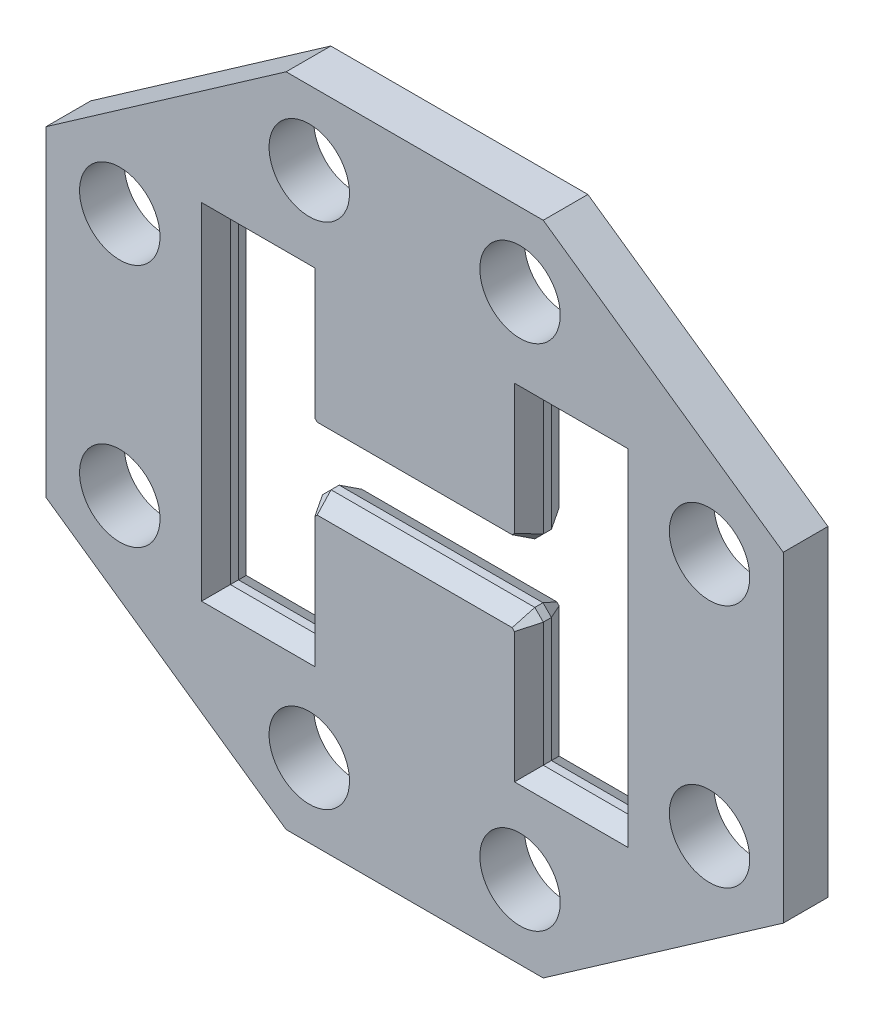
from build123d import *

# Parameters (mm, degrees)
MAIN_PLATE_DEPTH        = 31.75
CHAMFER4_SIZE           = 15
CHAMFER4_SIZE2          = 25.980762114
CHAMFER5_SIZE           = 15
CHAMFER5_SIZE2          = 25.980762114
CUT_EXTRUDE1_DEPTH      = 703.061769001
CUT_EXTRUDE1_DEPTH_BACK = 703.061769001
SKETCH5_R               = 57.15


with BuildPart() as part:
    # Sketch3 → Main Plate (new, symmetric)
    with BuildSketch(Plane(origin=(0, 0, 0), x_dir=(0, 1, 0), z_dir=(0, 0, 1))):
        Polygon((228.234235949, 523.855268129), (466.324268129, 182.70492307), (466.324268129, -182.70492307), (228.234235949, -523.855268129), (-228.234235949, -523.855268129), (-466.324268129, -182.70492307), (-466.324268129, 182.70492307), (-228.234235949, 523.855268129), align=None)
        Polygon((-54.229, 156.845), (-230.378, 156.845), (-230.378, 287.909), (230.378, 287.909), (230.378, 156.845), (54.229, 156.845), (42.164, 144.78), (42.164, -144.78), (54.229, -156.845), (230.378, -156.845), (230.378, -287.909), (-230.378, -287.909), (-230.378, -156.845), (-54.229, -156.845), (-42.164, -144.78), (-42.164, 144.78), align=None, mode=Mode.SUBTRACT)
    extrude(amount=MAIN_PLATE_DEPTH, both=True)

    # Chamfer4
    chamfer4_edges = [part.edges().sort_by_distance(p)[0] for p in [
        (150.8125, -48.1965, 31.75),
        (156.845, -142.3035, 31.75),
        (222.377, -230.378, 31.75),
        (287.909, 0, 31.75),
        (222.377, 230.378, 31.75),
        (156.845, 142.3035, 31.75),
        (150.8125, 48.1965, 31.75),
        (0, 42.164, 31.75),
        (-150.8125, 48.1965, 31.75),
        (-156.845, 142.3035, 31.75),
        (-222.377, 230.378, 31.75),
        (-287.909, 0, 31.75),
        (-222.377, -230.378, 31.75),
        (-156.845, -142.3035, 31.75),
        (-150.8125, -48.1965, 31.75),
        (0, -42.164, 31.75),
    ]]
    chamfer4_side = [part.faces().sort_by_distance(p)[0] for p in [
        (-345.252406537, 335.776675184, 31.75),
    ]]
    chamfer(chamfer4_edges, length=CHAMFER4_SIZE, length2=CHAMFER4_SIZE2, reference=chamfer4_side[0])

    # Chamfer5
    chamfer5_edges = [part.edges().sort_by_distance(p)[0] for p in [
        (150.8125, -48.1965, -31.75),
        (156.845, -142.3035, -31.75),
        (222.377, -230.378, -31.75),
        (287.909, 0, -31.75),
        (222.377, 230.378, -31.75),
        (156.845, 142.3035, -31.75),
        (150.8125, 48.1965, -31.75),
        (0, 42.164, -31.75),
        (-150.8125, 48.1965, -31.75),
        (-156.845, 142.3035, -31.75),
        (-222.377, 230.378, -31.75),
        (-287.909, 0, -31.75),
        (-222.377, -230.378, -31.75),
        (-156.845, -142.3035, -31.75),
        (-150.8125, -48.1965, -31.75),
        (0, -42.164, -31.75),
    ]]
    chamfer5_side = [part.faces().sort_by_distance(p)[0] for p in [
        (-345.252406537, 335.776675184, -31.75),
    ]]
    chamfer(chamfer5_edges, length=CHAMFER5_SIZE, length2=CHAMFER5_SIZE2, reference=chamfer5_side[0])

    # Sketch5 → Cut-Extrude1 (cut, two sides: drawn at the far end of the back side and taken through both)
    with BuildSketch(Plane(origin=(0, 0, 0), x_dir=(0, 1, 0), z_dir=(0, 0, 1)).offset(-CUT_EXTRUDE1_DEPTH_BACK)):
        with Locations(Location((-173.588730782, 419.080268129, 0), (0, 0, 270))):
            Circle(SKETCH5_R)
        with Locations(Location((173.588730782, 419.080268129, 0), (0, 0, 270))):
            Circle(SKETCH5_R)
        with Locations(Location((361.549268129, 149.758610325, 0), (0, 0, 270))):
            Circle(SKETCH5_R)
        with Locations(Location((361.549268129, -149.758610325, 0), (0, 0, 270))):
            Circle(SKETCH5_R)
        with Locations(Location((173.588730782, -419.080268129, 0), (0, 0, 270))):
            Circle(SKETCH5_R)
        with Locations(Location((-173.588730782, -419.080268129, 0), (0, 0, 270))):
            Circle(SKETCH5_R)
        with Locations(Location((-361.549268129, -149.758610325, 0), (0, 0, 270))):
            Circle(SKETCH5_R)
        with Locations(Location((-361.549268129, 149.758610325, 0), (0, 0, 270))):
            Circle(SKETCH5_R)
    extrude(amount=CUT_EXTRUDE1_DEPTH + CUT_EXTRUDE1_DEPTH_BACK, mode=Mode.SUBTRACT)


solid = part.part
